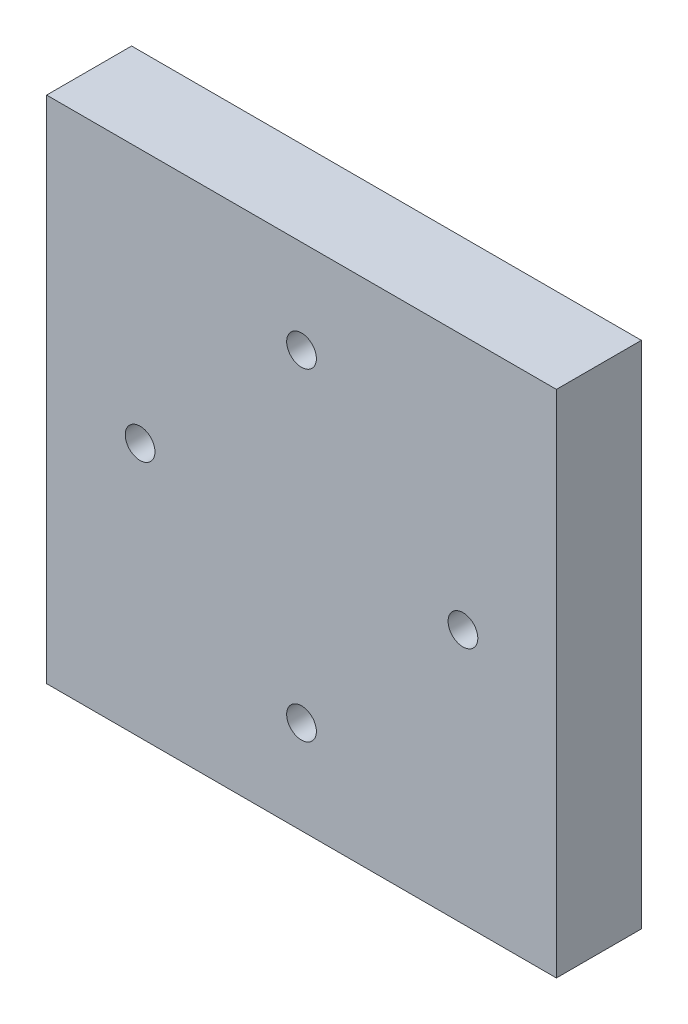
ISO-10303-21;
HEADER;
FILE_DESCRIPTION(('STEP AP214'),'2;1');
FILE_NAME('part.step','',(''),(''),'','','');
FILE_SCHEMA(('AUTOMOTIVE_DESIGN { 1 0 10303 214 1 1 1 1 }'));
ENDSEC;
DATA;
#1=APPLICATION_CONTEXT('core data for automotive mechanical design processes');
#2=APPLICATION_PROTOCOL_DEFINITION('international standard','automotive_design',2000,#1);
#3=PRODUCT_CONTEXT('',#1,'mechanical');
#4=PRODUCT('Part','Part','',(#3));
#5=PRODUCT_RELATED_PRODUCT_CATEGORY('part','',(#4));
#6=PRODUCT_DEFINITION_FORMATION('','',#4);
#7=PRODUCT_DEFINITION_CONTEXT('part definition',#1,'design');
#8=PRODUCT_DEFINITION('design','',#6,#7);
#9=PRODUCT_DEFINITION_SHAPE('','',#8);
#10=(LENGTH_UNIT() NAMED_UNIT(*) SI_UNIT(.MILLI.,.METRE.));
#11=(NAMED_UNIT(*) PLANE_ANGLE_UNIT() SI_UNIT($,.RADIAN.));
#12=(NAMED_UNIT(*) SI_UNIT($,.STERADIAN.) SOLID_ANGLE_UNIT());
#13=UNCERTAINTY_MEASURE_WITH_UNIT(LENGTH_MEASURE(1.E-05),#10,'distance_accuracy_value','');
#14=(GEOMETRIC_REPRESENTATION_CONTEXT(3) GLOBAL_UNCERTAINTY_ASSIGNED_CONTEXT((#13)) GLOBAL_UNIT_ASSIGNED_CONTEXT((#10,
#11,#12)) REPRESENTATION_CONTEXT('',''));
#15=CARTESIAN_POINT('',(0.,0.,0.));
#16=DIRECTION('',(0.,0.,1.));
#17=DIRECTION('',(1.,0.,0.));
#18=AXIS2_PLACEMENT_3D('',#15,#16,#17);
#19=CARTESIAN_POINT('',(0.,0.,50.));
#20=DIRECTION('',(1.,0.,0.));
#21=DIRECTION('',(0.,0.,-1.));
#22=AXIS2_PLACEMENT_3D('',#19,#20,#21);
#23=PLANE('',#22);
#24=DIRECTION('',(0.,-1.,0.));
#25=VECTOR('',#24,1.);
#26=CARTESIAN_POINT('',(0.,0.,0.));
#27=LINE('',#26,#25);
#28=CARTESIAN_POINT('',(0.,300.,0.));
#29=VERTEX_POINT('',#28);
#30=CARTESIAN_POINT('',(0.,0.,0.));
#31=VERTEX_POINT('',#30);
#32=EDGE_CURVE('E123',#29,#31,#27,.T.);
#33=ORIENTED_EDGE('',*,*,#32,.T.);
#34=DIRECTION('',(0.,0.,-1.));
#35=VECTOR('',#34,1.);
#36=CARTESIAN_POINT('',(0.,0.,50.));
#37=LINE('',#36,#35);
#38=CARTESIAN_POINT('',(0.,0.,50.));
#39=VERTEX_POINT('',#38);
#40=EDGE_CURVE('E11',#39,#31,#37,.T.);
#41=ORIENTED_EDGE('',*,*,#40,.F.);
#42=DIRECTION('',(0.,-1.,0.));
#43=VECTOR('',#42,1.);
#44=CARTESIAN_POINT('',(0.,0.,50.));
#45=LINE('',#44,#43);
#46=CARTESIAN_POINT('',(0.,300.,50.));
#47=VERTEX_POINT('',#46);
#48=EDGE_CURVE('E124',#47,#39,#45,.T.);
#49=ORIENTED_EDGE('',*,*,#48,.F.);
#50=DIRECTION('',(0.,0.,-1.));
#51=VECTOR('',#50,1.);
#52=CARTESIAN_POINT('',(0.,300.,50.));
#53=LINE('',#52,#51);
#54=EDGE_CURVE('E130',#47,#29,#53,.T.);
#55=ORIENTED_EDGE('',*,*,#54,.T.);
#56=EDGE_LOOP('',(#33,#41,#49,#55));
#57=FACE_BOUND('',#56,.T.);
#58=ADVANCED_FACE('F31',(#57),#23,.F.);
#59=CARTESIAN_POINT('',(0.,0.,50.));
#60=DIRECTION('',(0.,1.,0.));
#61=DIRECTION('',(0.,0.,1.));
#62=AXIS2_PLACEMENT_3D('',#59,#60,#61);
#63=PLANE('',#62);
#64=DIRECTION('',(1.,0.,0.));
#65=VECTOR('',#64,1.);
#66=CARTESIAN_POINT('',(0.,0.,0.));
#67=LINE('',#66,#65);
#68=CARTESIAN_POINT('',(300.,0.,0.));
#69=VERTEX_POINT('',#68);
#70=EDGE_CURVE('E133',#31,#69,#67,.T.);
#71=ORIENTED_EDGE('',*,*,#70,.T.);
#72=DIRECTION('',(0.,0.,-1.));
#73=VECTOR('',#72,1.);
#74=CARTESIAN_POINT('',(300.,0.,50.));
#75=LINE('',#74,#73);
#76=CARTESIAN_POINT('',(300.,0.,50.));
#77=VERTEX_POINT('',#76);
#78=EDGE_CURVE('E39',#77,#69,#75,.T.);
#79=ORIENTED_EDGE('',*,*,#78,.F.);
#80=DIRECTION('',(1.,0.,0.));
#81=VECTOR('',#80,1.);
#82=CARTESIAN_POINT('',(0.,0.,50.));
#83=LINE('',#82,#81);
#84=EDGE_CURVE('E78',#39,#77,#83,.T.);
#85=ORIENTED_EDGE('',*,*,#84,.F.);
#86=ORIENTED_EDGE('',*,*,#40,.T.);
#87=EDGE_LOOP('',(#71,#79,#85,#86));
#88=FACE_BOUND('',#87,.T.);
#89=ADVANCED_FACE('F157',(#88),#63,.F.);
#90=CARTESIAN_POINT('',(300.,0.,50.));
#91=DIRECTION('',(-1.,0.,0.));
#92=DIRECTION('',(0.,0.,1.));
#93=AXIS2_PLACEMENT_3D('',#90,#91,#92);
#94=PLANE('',#93);
#95=DIRECTION('',(0.,1.,0.));
#96=VECTOR('',#95,1.);
#97=CARTESIAN_POINT('',(300.,0.,0.));
#98=LINE('',#97,#96);
#99=CARTESIAN_POINT('',(300.,300.,0.));
#100=VERTEX_POINT('',#99);
#101=EDGE_CURVE('E65',#69,#100,#98,.T.);
#102=ORIENTED_EDGE('',*,*,#101,.T.);
#103=DIRECTION('',(0.,0.,-1.));
#104=VECTOR('',#103,1.);
#105=CARTESIAN_POINT('',(300.,300.,50.));
#106=LINE('',#105,#104);
#107=CARTESIAN_POINT('',(300.,300.,50.));
#108=VERTEX_POINT('',#107);
#109=EDGE_CURVE('E138',#108,#100,#106,.T.);
#110=ORIENTED_EDGE('',*,*,#109,.F.);
#111=DIRECTION('',(0.,1.,0.));
#112=VECTOR('',#111,1.);
#113=CARTESIAN_POINT('',(300.,0.,50.));
#114=LINE('',#113,#112);
#115=EDGE_CURVE('E127',#77,#108,#114,.T.);
#116=ORIENTED_EDGE('',*,*,#115,.F.);
#117=ORIENTED_EDGE('',*,*,#78,.T.);
#118=EDGE_LOOP('',(#102,#110,#116,#117));
#119=FACE_BOUND('',#118,.T.);
#120=ADVANCED_FACE('F140',(#119),#94,.F.);
#121=CARTESIAN_POINT('',(0.,300.,50.));
#122=DIRECTION('',(0.,-1.,0.));
#123=DIRECTION('',(0.,0.,-1.));
#124=AXIS2_PLACEMENT_3D('',#121,#122,#123);
#125=PLANE('',#124);
#126=DIRECTION('',(-1.,0.,0.));
#127=VECTOR('',#126,1.);
#128=CARTESIAN_POINT('',(0.,300.,0.));
#129=LINE('',#128,#127);
#130=EDGE_CURVE('E71',#100,#29,#129,.T.);
#131=ORIENTED_EDGE('',*,*,#130,.T.);
#132=ORIENTED_EDGE('',*,*,#54,.F.);
#133=DIRECTION('',(-1.,0.,0.));
#134=VECTOR('',#133,1.);
#135=CARTESIAN_POINT('',(0.,300.,50.));
#136=LINE('',#135,#134);
#137=EDGE_CURVE('E47',#108,#47,#136,.T.);
#138=ORIENTED_EDGE('',*,*,#137,.F.);
#139=ORIENTED_EDGE('',*,*,#109,.T.);
#140=EDGE_LOOP('',(#131,#132,#138,#139));
#141=FACE_BOUND('',#140,.T.);
#142=ADVANCED_FACE('F147',(#141),#125,.F.);
#143=CARTESIAN_POINT('',(0.,300.,50.));
#144=DIRECTION('',(0.,0.,-1.));
#145=DIRECTION('',(-1.,0.,0.));
#146=AXIS2_PLACEMENT_3D('',#143,#144,#145);
#147=PLANE('',#146);
#148=CARTESIAN_POINT('',(245.,150.000000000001,50.));
#149=DIRECTION('',(0.,0.,1.));
#150=DIRECTION('',(1.,0.,0.));
#151=AXIS2_PLACEMENT_3D('',#148,#149,#150);
#152=CIRCLE('',#151,8.75000000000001);
#153=CARTESIAN_POINT('',(253.75,150.000000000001,50.));
#154=VERTEX_POINT('',#153);
#155=EDGE_CURVE('E100',#154,#154,#152,.T.);
#156=ORIENTED_EDGE('',*,*,#155,.F.);
#157=EDGE_LOOP('',(#156));
#158=FACE_BOUND('',#157,.T.);
#159=CARTESIAN_POINT('',(150.000000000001,55.,50.));
#160=DIRECTION('',(0.,0.,1.));
#161=DIRECTION('',(1.,0.,0.));
#162=AXIS2_PLACEMENT_3D('',#159,#160,#161);
#163=CIRCLE('',#162,8.74999999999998);
#164=CARTESIAN_POINT('',(158.750000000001,55.,50.));
#165=VERTEX_POINT('',#164);
#166=EDGE_CURVE('E108',#165,#165,#163,.T.);
#167=ORIENTED_EDGE('',*,*,#166,.F.);
#168=EDGE_LOOP('',(#167));
#169=FACE_BOUND('',#168,.T.);
#170=CARTESIAN_POINT('',(55.,150.,50.));
#171=DIRECTION('',(0.,0.,1.));
#172=DIRECTION('',(1.,0.,0.));
#173=AXIS2_PLACEMENT_3D('',#170,#171,#172);
#174=CIRCLE('',#173,8.74999999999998);
#175=CARTESIAN_POINT('',(63.75,150.,50.));
#176=VERTEX_POINT('',#175);
#177=EDGE_CURVE('E114',#176,#176,#174,.T.);
#178=ORIENTED_EDGE('',*,*,#177,.F.);
#179=EDGE_LOOP('',(#178));
#180=FACE_BOUND('',#179,.T.);
#181=CARTESIAN_POINT('',(150.,245.,50.));
#182=DIRECTION('',(0.,0.,1.));
#183=DIRECTION('',(1.,0.,0.));
#184=AXIS2_PLACEMENT_3D('',#181,#182,#183);
#185=CIRCLE('',#184,8.74999999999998);
#186=CARTESIAN_POINT('',(158.75,245.,50.));
#187=VERTEX_POINT('',#186);
#188=EDGE_CURVE('E120',#187,#187,#185,.T.);
#189=ORIENTED_EDGE('',*,*,#188,.F.);
#190=EDGE_LOOP('',(#189));
#191=FACE_BOUND('',#190,.T.);
#192=ORIENTED_EDGE('',*,*,#48,.T.);
#193=ORIENTED_EDGE('',*,*,#84,.T.);
#194=ORIENTED_EDGE('',*,*,#115,.T.);
#195=ORIENTED_EDGE('',*,*,#137,.T.);
#196=EDGE_LOOP('',(#192,#193,#194,#195));
#197=FACE_BOUND('',#196,.T.);
#198=ADVANCED_FACE('F149',(#158,#169,#180,#191,#197),#147,.F.);
#199=CARTESIAN_POINT('',(0.,300.,0.));
#200=DIRECTION('',(0.,0.,-1.));
#201=DIRECTION('',(-1.,0.,0.));
#202=AXIS2_PLACEMENT_3D('',#199,#200,#201);
#203=PLANE('',#202);
#204=ORIENTED_EDGE('',*,*,#32,.F.);
#205=ORIENTED_EDGE('',*,*,#130,.F.);
#206=ORIENTED_EDGE('',*,*,#101,.F.);
#207=ORIENTED_EDGE('',*,*,#70,.F.);
#208=EDGE_LOOP('',(#204,#205,#206,#207));
#209=FACE_BOUND('',#208,.T.);
#210=ADVANCED_FACE('F143',(#209),#203,.T.);
#211=CARTESIAN_POINT('',(150.,245.,50.));
#212=DIRECTION('',(0.,0.,1.));
#213=DIRECTION('',(1.,0.,0.));
#214=AXIS2_PLACEMENT_3D('',#211,#212,#213);
#215=CYLINDRICAL_SURFACE('',#214,8.74999999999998);
#216=CARTESIAN_POINT('',(150.,245.,20.));
#217=DIRECTION('',(0.,0.,1.));
#218=DIRECTION('',(1.,0.,0.));
#219=AXIS2_PLACEMENT_3D('',#216,#217,#218);
#220=CIRCLE('',#219,8.74999999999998);
#221=CARTESIAN_POINT('',(158.75,245.,20.));
#222=VERTEX_POINT('',#221);
#223=EDGE_CURVE('E117',#222,#222,#220,.T.);
#224=ORIENTED_EDGE('',*,*,#223,.F.);
#225=EDGE_LOOP('',(#224));
#226=FACE_BOUND('',#225,.T.);
#227=ORIENTED_EDGE('',*,*,#188,.T.);
#228=EDGE_LOOP('',(#227));
#229=FACE_BOUND('',#228,.T.);
#230=ADVANCED_FACE('F184',(#226,#229),#215,.F.);
#231=CARTESIAN_POINT('',(150.,245.,20.));
#232=DIRECTION('',(0.,0.,1.));
#233=DIRECTION('',(1.,0.,0.));
#234=AXIS2_PLACEMENT_3D('',#231,#232,#233);
#235=CONICAL_SURFACE('',#234,8.74999999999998,1.02974425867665);
#236=CARTESIAN_POINT('',(150.,245.,14.7424695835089));
#237=VERTEX_POINT('',#236);
#238=VERTEX_LOOP('',#237);
#239=FACE_BOUND('',#238,.T.);
#240=ORIENTED_EDGE('',*,*,#223,.T.);
#241=EDGE_LOOP('',(#240));
#242=FACE_BOUND('',#241,.T.);
#243=ADVANCED_FACE('F192',(#239,#242),#235,.F.);
#244=CARTESIAN_POINT('',(55.,150.,50.));
#245=DIRECTION('',(0.,0.,1.));
#246=DIRECTION('',(1.,0.,0.));
#247=AXIS2_PLACEMENT_3D('',#244,#245,#246);
#248=CYLINDRICAL_SURFACE('',#247,8.74999999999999);
#249=CARTESIAN_POINT('',(55.,150.,20.));
#250=DIRECTION('',(0.,0.,1.));
#251=DIRECTION('',(1.,0.,0.));
#252=AXIS2_PLACEMENT_3D('',#249,#250,#251);
#253=CIRCLE('',#252,8.74999999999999);
#254=CARTESIAN_POINT('',(63.75,150.,20.));
#255=VERTEX_POINT('',#254);
#256=EDGE_CURVE('E111',#255,#255,#253,.T.);
#257=ORIENTED_EDGE('',*,*,#256,.F.);
#258=EDGE_LOOP('',(#257));
#259=FACE_BOUND('',#258,.T.);
#260=ORIENTED_EDGE('',*,*,#177,.T.);
#261=EDGE_LOOP('',(#260));
#262=FACE_BOUND('',#261,.T.);
#263=ADVANCED_FACE('F202',(#259,#262),#248,.F.);
#264=CARTESIAN_POINT('',(55.,150.,20.));
#265=DIRECTION('',(0.,0.,1.));
#266=DIRECTION('',(1.,0.,0.));
#267=AXIS2_PLACEMENT_3D('',#264,#265,#266);
#268=CONICAL_SURFACE('',#267,8.74999999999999,1.02974425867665);
#269=CARTESIAN_POINT('',(55.,150.,14.7424695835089));
#270=VERTEX_POINT('',#269);
#271=VERTEX_LOOP('',#270);
#272=FACE_BOUND('',#271,.T.);
#273=ORIENTED_EDGE('',*,*,#256,.T.);
#274=EDGE_LOOP('',(#273));
#275=FACE_BOUND('',#274,.T.);
#276=ADVANCED_FACE('F217',(#272,#275),#268,.F.);
#277=CARTESIAN_POINT('',(150.000000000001,55.,50.));
#278=DIRECTION('',(0.,0.,1.));
#279=DIRECTION('',(1.,0.,0.));
#280=AXIS2_PLACEMENT_3D('',#277,#278,#279);
#281=CYLINDRICAL_SURFACE('',#280,8.74999999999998);
#282=CARTESIAN_POINT('',(150.000000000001,55.,20.));
#283=DIRECTION('',(0.,0.,1.));
#284=DIRECTION('',(1.,0.,0.));
#285=AXIS2_PLACEMENT_3D('',#282,#283,#284);
#286=CIRCLE('',#285,8.74999999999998);
#287=CARTESIAN_POINT('',(158.750000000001,55.,20.));
#288=VERTEX_POINT('',#287);
#289=EDGE_CURVE('E103',#288,#288,#286,.T.);
#290=ORIENTED_EDGE('',*,*,#289,.F.);
#291=EDGE_LOOP('',(#290));
#292=FACE_BOUND('',#291,.T.);
#293=ORIENTED_EDGE('',*,*,#166,.T.);
#294=EDGE_LOOP('',(#293));
#295=FACE_BOUND('',#294,.T.);
#296=ADVANCED_FACE('F227',(#292,#295),#281,.F.);
#297=CARTESIAN_POINT('',(150.000000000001,55.,20.));
#298=DIRECTION('',(0.,0.,1.));
#299=DIRECTION('',(1.,0.,0.));
#300=AXIS2_PLACEMENT_3D('',#297,#298,#299);
#301=CONICAL_SURFACE('',#300,8.74999999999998,1.02974425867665);
#302=CARTESIAN_POINT('',(150.000000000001,55.,14.7424695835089));
#303=VERTEX_POINT('',#302);
#304=VERTEX_LOOP('',#303);
#305=FACE_BOUND('',#304,.T.);
#306=ORIENTED_EDGE('',*,*,#289,.T.);
#307=EDGE_LOOP('',(#306));
#308=FACE_BOUND('',#307,.T.);
#309=ADVANCED_FACE('F237',(#305,#308),#301,.F.);
#310=CARTESIAN_POINT('',(245.,150.000000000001,50.));
#311=DIRECTION('',(0.,0.,1.));
#312=DIRECTION('',(1.,0.,0.));
#313=AXIS2_PLACEMENT_3D('',#310,#311,#312);
#314=CYLINDRICAL_SURFACE('',#313,8.75000000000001);
#315=CARTESIAN_POINT('',(245.,150.000000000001,20.));
#316=DIRECTION('',(0.,0.,1.));
#317=DIRECTION('',(1.,0.,0.));
#318=AXIS2_PLACEMENT_3D('',#315,#316,#317);
#319=CIRCLE('',#318,8.75000000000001);
#320=CARTESIAN_POINT('',(253.75,150.000000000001,20.));
#321=VERTEX_POINT('',#320);
#322=EDGE_CURVE('E98',#321,#321,#319,.T.);
#323=ORIENTED_EDGE('',*,*,#322,.F.);
#324=EDGE_LOOP('',(#323));
#325=FACE_BOUND('',#324,.T.);
#326=ORIENTED_EDGE('',*,*,#155,.T.);
#327=EDGE_LOOP('',(#326));
#328=FACE_BOUND('',#327,.T.);
#329=ADVANCED_FACE('F94',(#325,#328),#314,.F.);
#330=CARTESIAN_POINT('',(245.,150.000000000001,20.));
#331=DIRECTION('',(0.,0.,1.));
#332=DIRECTION('',(1.,0.,0.));
#333=AXIS2_PLACEMENT_3D('',#330,#331,#332);
#334=CONICAL_SURFACE('',#333,8.75000000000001,1.02974425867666);
#335=CARTESIAN_POINT('',(245.,150.000000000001,14.7424695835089));
#336=VERTEX_POINT('',#335);
#337=VERTEX_LOOP('',#336);
#338=FACE_BOUND('',#337,.T.);
#339=ORIENTED_EDGE('',*,*,#322,.T.);
#340=EDGE_LOOP('',(#339));
#341=FACE_BOUND('',#340,.T.);
#342=ADVANCED_FACE('F91',(#338,#341),#334,.F.);
#343=CLOSED_SHELL('',(#58,#89,#120,#142,#198,#210,#230,#243,#263,#276,#296,#309,#329,#342));
#344=MANIFOLD_SOLID_BREP('B2',#343);
#345=ADVANCED_BREP_SHAPE_REPRESENTATION('',(#18,#344),#14);
#346=SHAPE_DEFINITION_REPRESENTATION(#9,#345);
ENDSEC;
END-ISO-10303-21;
